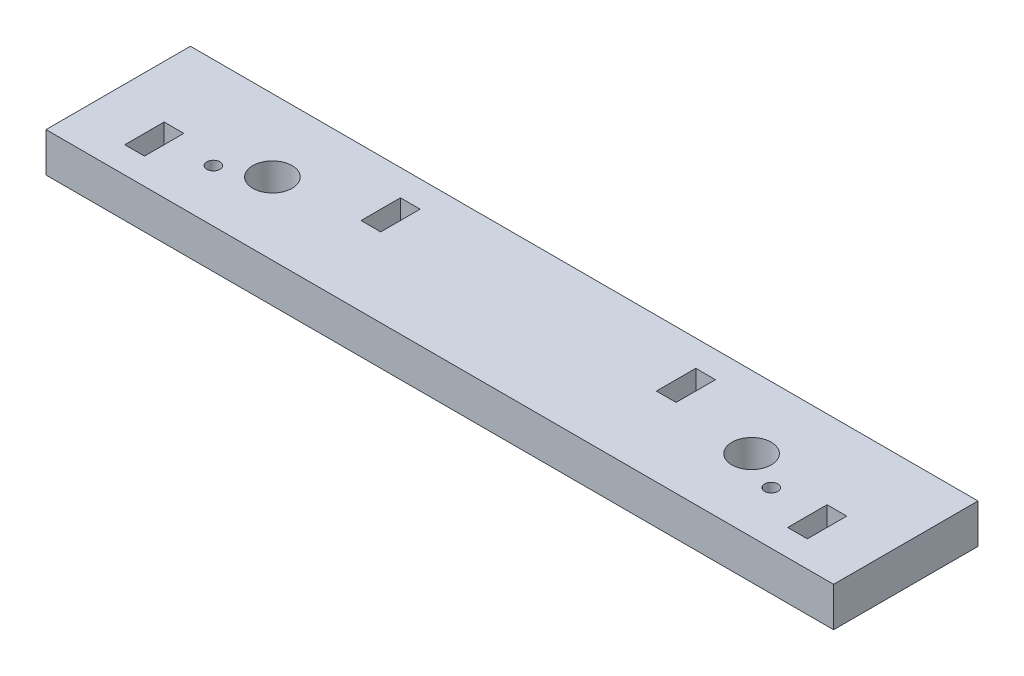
from build123d import *

# Parameters (mm, degrees)
SKETCH1_R           = 3.175
SKETCH1_W           = 190.5
SKETCH1_H           = 69.85
BOSS_EXTRUDE1_DEPTH = 19.05


with BuildPart() as part:
    # Sketch1 → Boss-Extrude1 (new body)
    # profile 1 of 2: a face of its own
    with BuildSketch(Plane(origin=(0, 0, 0), x_dir=(1, 0, 0), z_dir=(0, 1, 0))):
        Polygon((0, 12.7), (0, 0), (190.5, 0), (190.5, 69.85), (0, 69.85), (0, 57.15), align=None)
        Polygon((34.925, 12.7), (25.4, 12.7), (25.4, 22.225), (25.4, 31.75), (34.925, 31.75), (34.925, 22.225), align=None, mode=Mode.SUBTRACT)
        with Locations(Location((55.5625, 25.4, 0), (0, 0, 90))):
            Circle(SKETCH1_R, mode=Mode.SUBTRACT)
        with BuildLine():
            ThreePointArc((74.6125, 25.4), (67.877307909, 28.189807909), (65.0875, 34.925))
            ThreePointArc((65.0875, 34.925), (74.6125, 44.45), (84.1375, 34.925))
            ThreePointArc((84.1375, 34.925), (81.347692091, 28.189807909), (74.6125, 25.4))
        make_face(mode=Mode.SUBTRACT)
        Polygon((114.3, 47.625), (114.3, 57.15), (123.825, 57.15), (123.825, 47.625), (123.825, 38.1), (114.3, 38.1), align=None, mode=Mode.SUBTRACT)
    # profile 2 of 2: a face of its own
    with BuildSketch(Plane(origin=(0, 0, 0), x_dir=(1, 0, 0), z_dir=(0, 1, 0))):
        with Locations((285.75, 34.925)):
            Rectangle(SKETCH1_W, SKETCH1_H)
        with BuildLine():
            ThreePointArc((328.6125, 25.4), (325.4375, 22.225), (322.2625, 25.4))
            ThreePointArc((322.2625, 25.4), (325.4375, 28.575), (328.6125, 25.4))
        make_face(mode=Mode.SUBTRACT)
        Polygon((355.6, 12.7), (346.075, 12.7), (346.075, 22.225), (346.075, 31.75), (355.6, 31.75), (355.6, 22.225), align=None, mode=Mode.SUBTRACT)
        Polygon((257.175, 47.625), (257.175, 57.15), (266.7, 57.15), (266.7, 47.625), (266.7, 38.1), (257.175, 38.1), align=None, mode=Mode.SUBTRACT)
        with BuildLine():
            ThreePointArc((315.9125, 34.925), (313.122692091, 28.189807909), (306.3875, 25.4))
            ThreePointArc((306.3875, 25.4), (299.652307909, 28.189807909), (296.8625, 34.925))
            ThreePointArc((296.8625, 34.925), (306.3875, 44.45), (315.9125, 34.925))
        make_face(mode=Mode.SUBTRACT)
    extrude(amount=BOSS_EXTRUDE1_DEPTH)


solid = part.part
